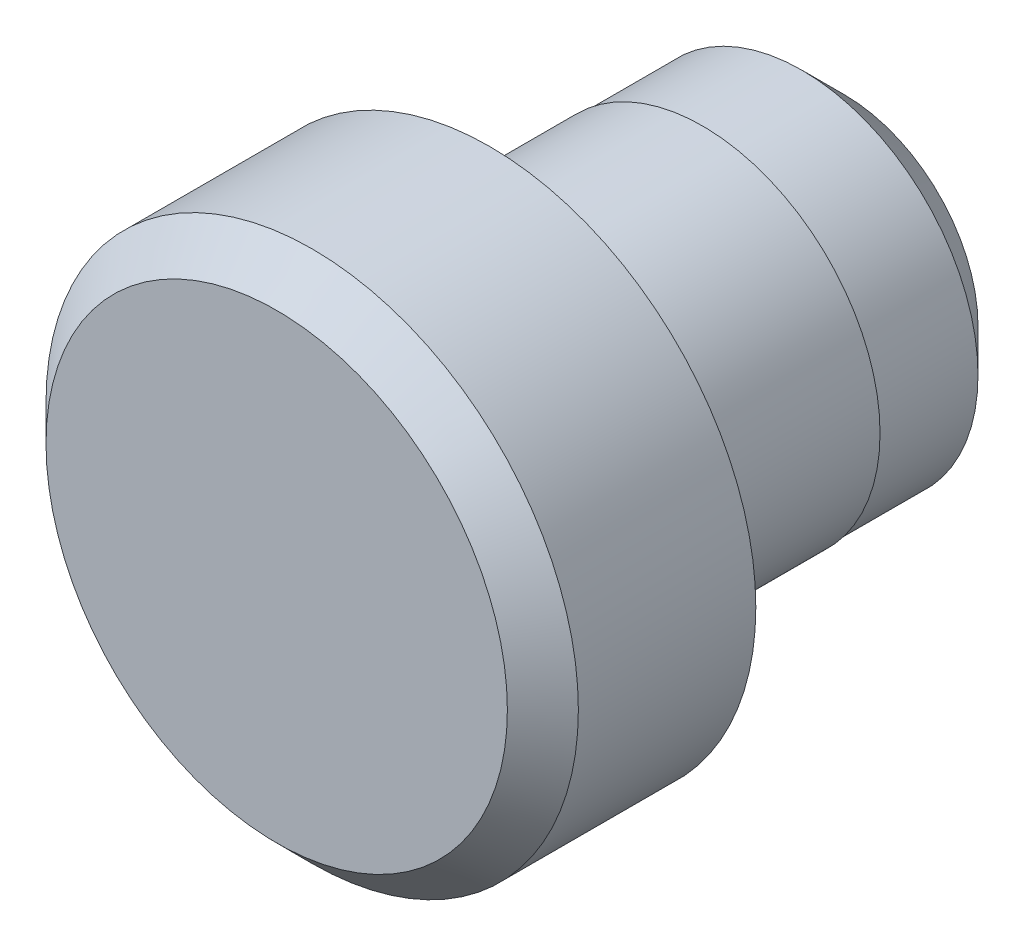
ISO-10303-21;
HEADER;
FILE_DESCRIPTION(('STEP AP214'),'2;1');
FILE_NAME('part.step','',(''),(''),'','','');
FILE_SCHEMA(('AUTOMOTIVE_DESIGN { 1 0 10303 214 1 1 1 1 }'));
ENDSEC;
DATA;
#1=APPLICATION_CONTEXT('core data for automotive mechanical design processes');
#2=APPLICATION_PROTOCOL_DEFINITION('international standard','automotive_design',2000,#1);
#3=PRODUCT_CONTEXT('',#1,'mechanical');
#4=PRODUCT('Part','Part','',(#3));
#5=PRODUCT_RELATED_PRODUCT_CATEGORY('part','',(#4));
#6=PRODUCT_DEFINITION_FORMATION('','',#4);
#7=PRODUCT_DEFINITION_CONTEXT('part definition',#1,'design');
#8=PRODUCT_DEFINITION('design','',#6,#7);
#9=PRODUCT_DEFINITION_SHAPE('','',#8);
#10=(LENGTH_UNIT() NAMED_UNIT(*) SI_UNIT(.MILLI.,.METRE.));
#11=(NAMED_UNIT(*) PLANE_ANGLE_UNIT() SI_UNIT($,.RADIAN.));
#12=(NAMED_UNIT(*) SI_UNIT($,.STERADIAN.) SOLID_ANGLE_UNIT());
#13=UNCERTAINTY_MEASURE_WITH_UNIT(LENGTH_MEASURE(1.E-05),#10,'distance_accuracy_value','');
#14=(GEOMETRIC_REPRESENTATION_CONTEXT(3) GLOBAL_UNCERTAINTY_ASSIGNED_CONTEXT((#13)) GLOBAL_UNIT_ASSIGNED_CONTEXT((#10,
#11,#12)) REPRESENTATION_CONTEXT('',''));
#15=CARTESIAN_POINT('',(0.,0.,0.));
#16=DIRECTION('',(0.,0.,1.));
#17=DIRECTION('',(1.,0.,0.));
#18=AXIS2_PLACEMENT_3D('',#15,#16,#17);
#19=CARTESIAN_POINT('',(0.,0.,3.));
#20=DIRECTION('',(0.,0.,-1.));
#21=DIRECTION('',(-1.,0.,0.));
#22=AXIS2_PLACEMENT_3D('',#19,#20,#21);
#23=PLANE('',#22);
#24=CARTESIAN_POINT('',(0.,0.,3.));
#25=DIRECTION('',(0.,0.,1.));
#26=DIRECTION('',(1.,0.,0.));
#27=AXIS2_PLACEMENT_3D('',#24,#25,#26);
#28=CIRCLE('',#27,3.25);
#29=CARTESIAN_POINT('',(3.25,0.,3.));
#30=VERTEX_POINT('',#29);
#31=EDGE_CURVE('E8',#30,#30,#28,.T.);
#32=ORIENTED_EDGE('',*,*,#31,.T.);
#33=EDGE_LOOP('',(#32));
#34=FACE_BOUND('',#33,.T.);
#35=ADVANCED_FACE('F12',(#34),#23,.F.);
#36=CARTESIAN_POINT('',(0.,0.,2.5));
#37=DIRECTION('',(0.,0.,-1.));
#38=DIRECTION('',(-1.,0.,0.));
#39=AXIS2_PLACEMENT_3D('',#36,#37,#38);
#40=CONICAL_SURFACE('',#39,3.75,0.785398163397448);
#41=ORIENTED_EDGE('',*,*,#31,.F.);
#42=EDGE_LOOP('',(#41));
#43=FACE_BOUND('',#42,.T.);
#44=CARTESIAN_POINT('',(0.,0.,2.5));
#45=DIRECTION('',(0.,0.,1.));
#46=DIRECTION('',(1.,0.,0.));
#47=AXIS2_PLACEMENT_3D('',#44,#45,#46);
#48=CIRCLE('',#47,3.75);
#49=CARTESIAN_POINT('',(3.75,0.,2.5));
#50=VERTEX_POINT('',#49);
#51=EDGE_CURVE('E18',#50,#50,#48,.T.);
#52=ORIENTED_EDGE('',*,*,#51,.T.);
#53=EDGE_LOOP('',(#52));
#54=FACE_BOUND('',#53,.T.);
#55=ADVANCED_FACE('F58',(#43,#54),#40,.T.);
#56=CARTESIAN_POINT('',(0.,0.,5.5));
#57=DIRECTION('',(0.,0.,1.));
#58=DIRECTION('',(1.,0.,0.));
#59=AXIS2_PLACEMENT_3D('',#56,#57,#58);
#60=CYLINDRICAL_SURFACE('',#59,3.75);
#61=ORIENTED_EDGE('',*,*,#51,.F.);
#62=EDGE_LOOP('',(#61));
#63=FACE_BOUND('',#62,.T.);
#64=CARTESIAN_POINT('',(0.,0.,0.));
#65=DIRECTION('',(0.,0.,1.));
#66=DIRECTION('',(1.,0.,0.));
#67=AXIS2_PLACEMENT_3D('',#64,#65,#66);
#68=CIRCLE('',#67,3.75);
#69=CARTESIAN_POINT('',(3.75,0.,0.));
#70=VERTEX_POINT('',#69);
#71=EDGE_CURVE('E22',#70,#70,#68,.T.);
#72=ORIENTED_EDGE('',*,*,#71,.T.);
#73=EDGE_LOOP('',(#72));
#74=FACE_BOUND('',#73,.T.);
#75=ADVANCED_FACE('F63',(#63,#74),#60,.T.);
#76=CARTESIAN_POINT('',(0.,2.5,0.));
#77=DIRECTION('',(0.,0.,1.));
#78=DIRECTION('',(1.,0.,0.));
#79=AXIS2_PLACEMENT_3D('',#76,#77,#78);
#80=PLANE('',#79);
#81=ORIENTED_EDGE('',*,*,#71,.F.);
#82=EDGE_LOOP('',(#81));
#83=FACE_BOUND('',#82,.T.);
#84=CARTESIAN_POINT('',(0.,0.,0.));
#85=DIRECTION('',(0.,0.,1.));
#86=DIRECTION('',(1.,0.,0.));
#87=AXIS2_PLACEMENT_3D('',#84,#85,#86);
#88=CIRCLE('',#87,2.5);
#89=CARTESIAN_POINT('',(2.5,0.,0.));
#90=VERTEX_POINT('',#89);
#91=EDGE_CURVE('E26',#90,#90,#88,.T.);
#92=ORIENTED_EDGE('',*,*,#91,.T.);
#93=EDGE_LOOP('',(#92));
#94=FACE_BOUND('',#93,.T.);
#95=ADVANCED_FACE('F69',(#83,#94),#80,.F.);
#96=CARTESIAN_POINT('',(0.,0.,5.5));
#97=DIRECTION('',(0.,0.,1.));
#98=DIRECTION('',(1.,0.,0.));
#99=AXIS2_PLACEMENT_3D('',#96,#97,#98);
#100=CYLINDRICAL_SURFACE('',#99,2.5);
#101=ORIENTED_EDGE('',*,*,#91,.F.);
#102=EDGE_LOOP('',(#101));
#103=FACE_BOUND('',#102,.T.);
#104=CARTESIAN_POINT('',(0.,0.,-3.));
#105=DIRECTION('',(0.,0.,1.));
#106=DIRECTION('',(1.,0.,0.));
#107=AXIS2_PLACEMENT_3D('',#104,#105,#106);
#108=CIRCLE('',#107,2.5);
#109=CARTESIAN_POINT('',(2.5,0.,-3.));
#110=VERTEX_POINT('',#109);
#111=EDGE_CURVE('E31',#110,#110,#108,.T.);
#112=ORIENTED_EDGE('',*,*,#111,.T.);
#113=EDGE_LOOP('',(#112));
#114=FACE_BOUND('',#113,.T.);
#115=ADVANCED_FACE('F75',(#103,#114),#100,.T.);
#116=CARTESIAN_POINT('',(0.,2.48,-3.));
#117=DIRECTION('',(0.,0.,1.));
#118=DIRECTION('',(1.,0.,0.));
#119=AXIS2_PLACEMENT_3D('',#116,#117,#118);
#120=PLANE('',#119);
#121=ORIENTED_EDGE('',*,*,#111,.F.);
#122=EDGE_LOOP('',(#121));
#123=FACE_BOUND('',#122,.T.);
#124=CARTESIAN_POINT('',(0.,0.,-3.));
#125=DIRECTION('',(0.,0.,1.));
#126=DIRECTION('',(1.,0.,0.));
#127=AXIS2_PLACEMENT_3D('',#124,#125,#126);
#128=CIRCLE('',#127,2.48);
#129=CARTESIAN_POINT('',(2.48,0.,-3.));
#130=VERTEX_POINT('',#129);
#131=EDGE_CURVE('E34',#130,#130,#128,.T.);
#132=ORIENTED_EDGE('',*,*,#131,.T.);
#133=EDGE_LOOP('',(#132));
#134=FACE_BOUND('',#133,.T.);
#135=ADVANCED_FACE('F79',(#123,#134),#120,.F.);
#136=CARTESIAN_POINT('',(0.,0.,5.5));
#137=DIRECTION('',(0.,0.,1.));
#138=DIRECTION('',(1.,0.,0.));
#139=AXIS2_PLACEMENT_3D('',#136,#137,#138);
#140=CYLINDRICAL_SURFACE('',#139,2.48);
#141=ORIENTED_EDGE('',*,*,#131,.F.);
#142=EDGE_LOOP('',(#141));
#143=FACE_BOUND('',#142,.T.);
#144=CARTESIAN_POINT('',(0.,0.,-4.4));
#145=DIRECTION('',(0.,0.,1.));
#146=DIRECTION('',(1.,0.,0.));
#147=AXIS2_PLACEMENT_3D('',#144,#145,#146);
#148=CIRCLE('',#147,2.48);
#149=CARTESIAN_POINT('',(2.48,0.,-4.4));
#150=VERTEX_POINT('',#149);
#151=EDGE_CURVE('E37',#150,#150,#148,.T.);
#152=ORIENTED_EDGE('',*,*,#151,.T.);
#153=EDGE_LOOP('',(#152));
#154=FACE_BOUND('',#153,.T.);
#155=ADVANCED_FACE('F54',(#143,#154),#140,.T.);
#156=CARTESIAN_POINT('',(0.,0.,-5.));
#157=DIRECTION('',(0.,0.,1.));
#158=DIRECTION('',(1.,0.,0.));
#159=AXIS2_PLACEMENT_3D('',#156,#157,#158);
#160=CONICAL_SURFACE('',#159,1.88,0.785398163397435);
#161=ORIENTED_EDGE('',*,*,#151,.F.);
#162=EDGE_LOOP('',(#161));
#163=FACE_BOUND('',#162,.T.);
#164=CARTESIAN_POINT('',(0.,0.,-5.));
#165=DIRECTION('',(0.,0.,1.));
#166=DIRECTION('',(1.,0.,0.));
#167=AXIS2_PLACEMENT_3D('',#164,#165,#166);
#168=CIRCLE('',#167,1.88);
#169=CARTESIAN_POINT('',(1.88,0.,-5.));
#170=VERTEX_POINT('',#169);
#171=EDGE_CURVE('E40',#170,#170,#168,.T.);
#172=ORIENTED_EDGE('',*,*,#171,.T.);
#173=EDGE_LOOP('',(#172));
#174=FACE_BOUND('',#173,.T.);
#175=ADVANCED_FACE('F44',(#163,#174),#160,.T.);
#176=CARTESIAN_POINT('',(0.,1.88,-5.));
#177=DIRECTION('',(0.,0.,1.));
#178=DIRECTION('',(1.,0.,0.));
#179=AXIS2_PLACEMENT_3D('',#176,#177,#178);
#180=PLANE('',#179);
#181=ORIENTED_EDGE('',*,*,#171,.F.);
#182=EDGE_LOOP('',(#181));
#183=FACE_BOUND('',#182,.T.);
#184=ADVANCED_FACE('F46',(#183),#180,.F.);
#185=CLOSED_SHELL('',(#35,#55,#75,#95,#115,#135,#155,#175,#184));
#186=MANIFOLD_SOLID_BREP('B1',#185);
#187=ADVANCED_BREP_SHAPE_REPRESENTATION('',(#18,#186),#14);
#188=SHAPE_DEFINITION_REPRESENTATION(#9,#187);
ENDSEC;
END-ISO-10303-21;
